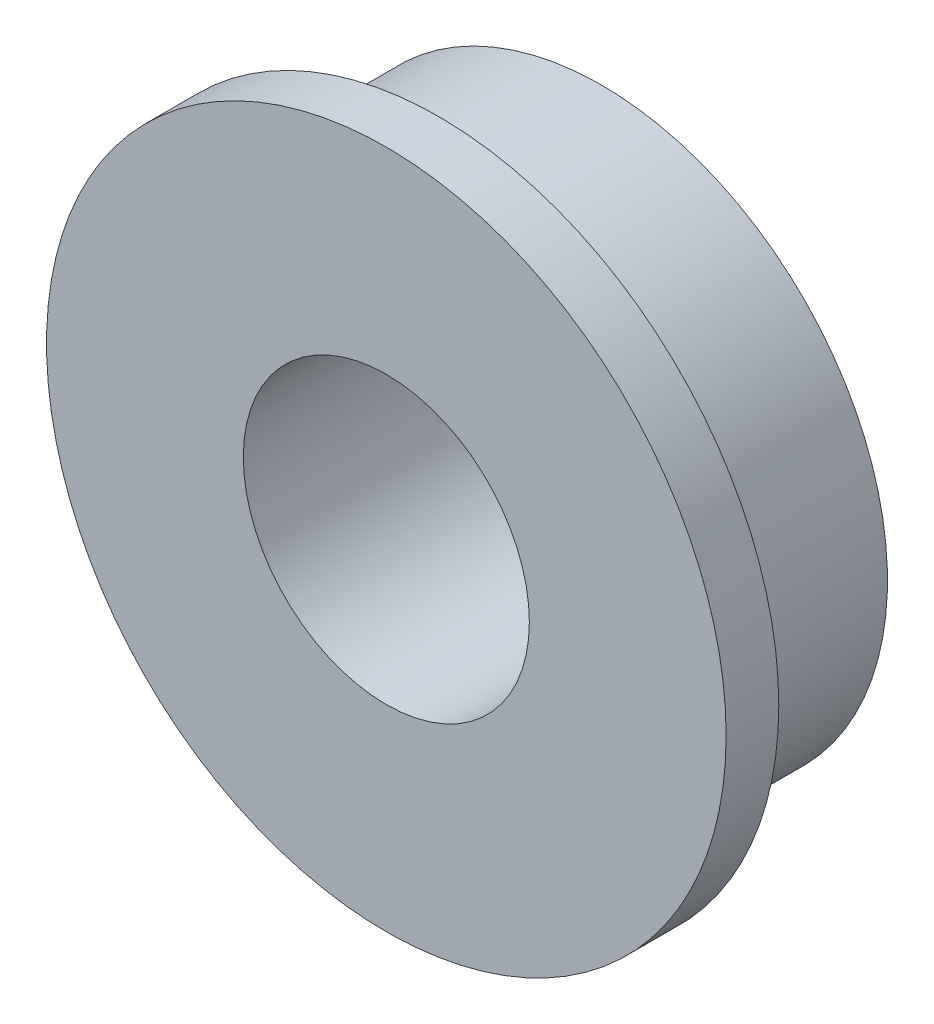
from build123d import *

# Parameters (mm, degrees)
SKETCH1_R      = 3.175
SKETCH1_R_2    = 1.5875
EXTRUDE1_DEPTH = 2.3876
EXTRUDE2_START = -0.5842
SKETCH2_R      = 3.7719
SKETCH2_R_2    = 3.175
EXTRUDE2_DEPTH = 0.5842


with BuildPart() as part:
    # Sketch1 → Extrude1 (new body)
    with BuildSketch(Plane.XY):
        Circle(SKETCH1_R)
        Circle(SKETCH1_R_2, mode=Mode.SUBTRACT)
    extrude(amount=EXTRUDE1_DEPTH)

    # Sketch2 → Extrude2 (add)
    with BuildSketch(Plane.XY.offset(2.3876).offset(EXTRUDE2_START)):
        Circle(SKETCH2_R)
        Circle(SKETCH2_R_2, mode=Mode.SUBTRACT)
    extrude(amount=EXTRUDE2_DEPTH)


solid = part.part
